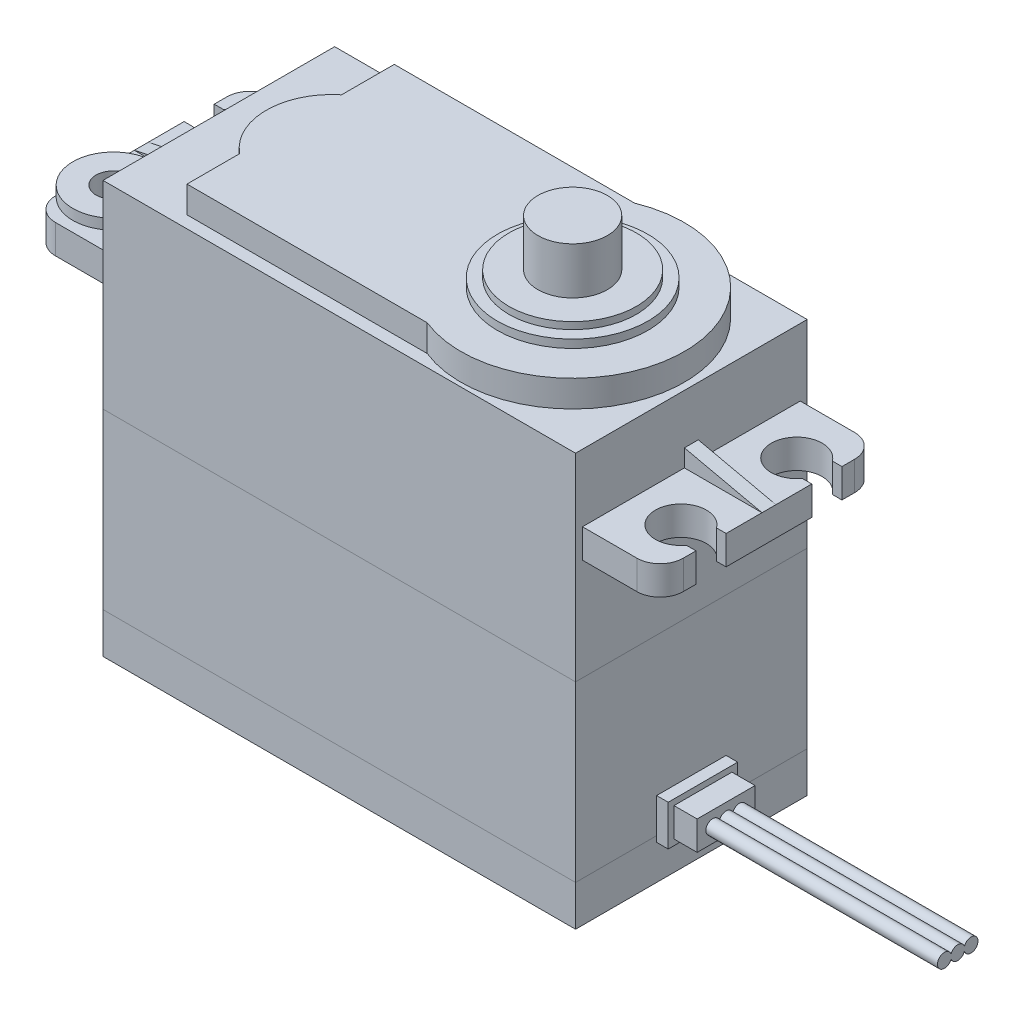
from build123d import *

# Parameters (mm, degrees)
ESQUISSE1_W                              = 40.8
ESQUISSE1_H                              = 20
BOSS_EXTRU_1_DEPTH                       = 35.6
BOSS_EXTRU_2_DEPTH                       = 2.5
BOSS_EXTRU_3_DEPTH                       = 0.6
CONG_1_R                                 = 2
BOSS_EXTRU_4_DEPTH                       = 2.3
ESQUISSE5_R                              = 6.5
BOSS_EXTRU_5_DEPTH                       = 0.7
ESQUISSE6_R                              = 5.5
BOSS_EXTRU_6_DEPTH                       = 0.6
ESQUISSE7_R                              = 3
BOSS_EXTRU_7_DEPTH                       = 4.05
ESQUISSE10_W                             = 2.2
ESQUISSE10_H                             = 29.8
DIAM_TRE_DU_PER_AGE_4_4_4_4_1_AT_2_COUNT = 2
DIAM_TRE_DU_PER_AGE_4_4_4_4_1_AT_2_PITCH = 10
DIAM_TRE_DU_PER_AGE_4_4_4_4_1_AT_3_COUNT = 2
DIAM_TRE_DU_PER_AGE_4_4_4_4_1_AT_3_PITCH = 50.009999
DIAM_TRE_DU_PER_AGE_4_4_4_4_1_AT_4_COUNT = 2
DIAM_TRE_DU_PER_AGE_4_4_4_4_1_AT_4_PITCH = 49
ESQUISSE13_W                             = 6
ESQUISSE13_H                             = 3.5
BOSS_EXTRU_8_DEPTH                       = 1
ESQUISSE14_W                             = 5
ESQUISSE14_H                             = 2.5
BOSS_EXTRU_9_DEPTH                       = 2
BOSS_EXTRU_10_DEPTH                      = 20


with BuildPart() as part:
    # Esquisse1 → Boss.-Extru.1 (new body)
    with BuildSketch(Plane(origin=(0, 0, 0), x_dir=(1, 0, 0), z_dir=(0, 1, 0))):
        Rectangle(ESQUISSE1_W, ESQUISSE1_H)
    extrude(amount=BOSS_EXTRU_1_DEPTH)

    # Esquisse2 → Boss.-Extru.2 (add)
    with BuildSketch(Plane(origin=(0, 27.3, 0), x_dir=(-1, 0, 0), z_dir=(0, -1, 0))):
        with BuildLine():
            Line((-27.1, 9.4), (-20.4, 9.4))
            Line((-20.4, 9.4), (-20.4, -9.4))
            Line((-20.4, -9.4), (-27.1, -9.4))
            Line((-27.1, -9.4), (-27.1, -6.3))
            Line((-27.1, -6.3), (-26.212454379, -6.3))
            ThreePointArc((-26.212454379, -6.3), (-22.35, -5), (-26.212454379, -3.7))
            Line((-26.212454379, -3.7), (-27.1, -3.7))
            Line((-27.1, -3.7), (-27.1, 3.7))
            Line((-27.1, 3.7), (-26.212454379, 3.7))
            ThreePointArc((-26.212454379, 3.7), (-22.35, 5), (-26.212454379, 6.3))
            Line((-26.212454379, 6.3), (-27.1, 6.3))
            Line((-27.1, 6.3), (-27.1, 9.4))
        make_face()
        with BuildLine():
            Line((27.1, 9.4), (20.4, 9.4))
            Line((20.4, 9.4), (20.4, -9.4))
            Line((20.4, -9.4), (27.1, -9.4))
            Line((27.1, -9.4), (27.1, -6.3))
            Line((27.1, -6.3), (26.212454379, -6.3))
            ThreePointArc((26.212454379, -6.3), (22.35, -5), (26.212454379, -3.7))
            Line((26.212454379, -3.7), (27.1, -3.7))
            Line((27.1, -3.7), (27.1, 3.7))
            Line((27.1, 3.7), (26.212454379, 3.7))
            ThreePointArc((26.212454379, 3.7), (22.35, 5), (26.212454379, 6.3))
            Line((26.212454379, 6.3), (27.1, 6.3))
            Line((27.1, 6.3), (27.1, 9.4))
        make_face()
    extrude(amount=-BOSS_EXTRU_2_DEPTH)

    # Esquisse3 → Boss.-Extru.3 (add, symmetric)
    with BuildSketch(Plane.XY):
        Polygon((-27.1, 29.8), (-20.4, 29.8), (-20.4, 31.3), align=None)
        Polygon((27.1, 29.8), (20.4, 29.8), (20.4, 31.3), align=None)
    extrude(amount=BOSS_EXTRU_3_DEPTH, both=True)

    # Cong_1
    cong_1_edges = [part.edges().sort_by_distance(p)[0] for p in [
        (27.1, 28.55, -9.4),
        (27.1, 28.55, 9.4),
        (-27.1, 28.55, -9.4),
        (-27.1, 28.55, 9.4),
    ]]
    fillet(cong_1_edges, radius=CONG_1_R)

    # Esquisse4 → Boss.-Extru.4 (add)
    with BuildSketch(Plane(origin=(0, 35.6, 0), x_dir=(1, 0, 0), z_dir=(0, 1, 0))):
        with BuildLine():
            Line((-14.2, 8.95), (6.541676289, 8.95))
            ThreePointArc((6.541676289, 8.95), (19.8, 0), (6.541676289, -8.95))
            Line((6.541676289, -8.95), (-14.2, -8.95))
            Line((-14.2, -8.95), (-14.2, -4.4))
            ThreePointArc((-14.2, -4.4), (-16.3, 0), (-14.2, 4.4))
            Line((-14.2, 4.4), (-14.2, 8.95))
        make_face()
    extrude(amount=BOSS_EXTRU_4_DEPTH)

    # Esquisse5 → Boss.-Extru.5 (add)
    with BuildSketch(Plane(origin=(0, 37.9, 0), x_dir=(1, 0, 0), z_dir=(0, 1, 0))):
        with Locations(Location((10.15, 0, 0), (0, 0, 270))):
            Circle(ESQUISSE5_R)
    extrude(amount=BOSS_EXTRU_5_DEPTH)

    # Esquisse6 → Boss.-Extru.6 (add)
    with BuildSketch(Plane(origin=(0, 38.6, 0), x_dir=(1, 0, 0), z_dir=(0, 1, 0))):
        with Locations(Location((10.15, 0, 0), (0, 0, 270))):
            Circle(ESQUISSE6_R)
    extrude(amount=BOSS_EXTRU_6_DEPTH)

    # Esquisse10 → Diam_tre du per_age _4.4 _4.4_1 (revolve, cut)
    with BuildSketch(Plane(origin=(-24.5, 29.8, -5), x_dir=(0, 0, 1), z_dir=(1, 0, 0))):
        with Locations((1.1, 14.9)):
            Rectangle(ESQUISSE10_W, ESQUISSE10_H)
    diam_tre_du_per_age_4_4_4_4_1 = revolve(axis=Axis((-24.5, 36.15, -5), (0, -1, 0)), mode=Mode.SUBTRACT)

    # Diam_tre du per_age _4.4 _4.4_1 at 2: Diam_tre du per_age _4.4 _4.4_1 ×2
    with Locations(*[(0, 0, i * DIAM_TRE_DU_PER_AGE_4_4_4_4_1_AT_2_PITCH) for i in range(1, DIAM_TRE_DU_PER_AGE_4_4_4_4_1_AT_2_COUNT)]):
        add(diam_tre_du_per_age_4_4_4_4_1, mode=Mode.SUBTRACT)

    # Diam_tre du per_age _4.4 _4.4_1 at 3: Diam_tre du per_age _4.4 _4.4_1 ×2
    with Locations(*[Vector(0.9798040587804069, 0, 0.1999600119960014) * (i * DIAM_TRE_DU_PER_AGE_4_4_4_4_1_AT_3_PITCH) for i in range(1, DIAM_TRE_DU_PER_AGE_4_4_4_4_1_AT_3_COUNT)]):
        add(diam_tre_du_per_age_4_4_4_4_1, mode=Mode.SUBTRACT)

    # Diam_tre du per_age _4.4 _4.4_1 at 4: Diam_tre du per_age _4.4 _4.4_1 ×2
    with Locations(*[(i * DIAM_TRE_DU_PER_AGE_4_4_4_4_1_AT_4_PITCH, 0, 0) for i in range(1, DIAM_TRE_DU_PER_AGE_4_4_4_4_1_AT_4_COUNT)]):
        add(diam_tre_du_per_age_4_4_4_4_1, mode=Mode.SUBTRACT)

    # Esquisse12 → R_volution1 (revolve)
    with BuildSketch(Plane(origin=(-24.5, 0, 0), x_dir=(0, 0, -1), z_dir=(1, 0, 0)), mode=Mode.PRIVATE) as r_volution1_sk:
        Polygon((-8.5, 29.8), (-8.5, 30.7), (-6.5, 30.7), (-6.5, 26.4), (-8.5, 26.4), (-8.5, 27.3), (-7.2, 27.3), (-7.2, 29.8), align=None)
    revolve(r_volution1_sk.sketch.rotate(Axis((-24.5, 27.3, 5), (0, 1, 0)), 180), axis=Axis((-24.5, 27.3, 5), (0, 1, 0)))



with BuildPart() as body_2:
    # Esquisse7 → Boss.-Extru.7 (new body)
    with BuildSketch(Plane(origin=(0, 39.2, 0), x_dir=(1, 0, 0), z_dir=(0, 1, 0))):
        with Locations(Location((10.15, 0, 0), (0, 0, 270))):
            Circle(ESQUISSE7_R)
    extrude(amount=BOSS_EXTRU_7_DEPTH)


with BuildPart() as body_3:
    # Esquisse13 → Boss.-Extru.8 (new body)
    with BuildSketch(Plane(origin=(20.4, 0, 0), x_dir=(0, 0, -1), z_dir=(1, 0, 0))):
        with Locations((0, 4.75)):
            Rectangle(ESQUISSE13_W, ESQUISSE13_H)
    extrude(amount=BOSS_EXTRU_8_DEPTH)


with BuildPart() as part_1:
    add(part.part)

    add(body_3.part)  # Boss.-Extru.9 merges body 3
    # Esquisse14 → Boss.-Extru.9 (add)
    with BuildSketch(Plane(origin=(21.4, 0, 0), x_dir=(0, 0, -1), z_dir=(1, 0, 0))):
        with Locations((0, 4.75)):
            Rectangle(ESQUISSE14_W, ESQUISSE14_H)
    extrude(amount=BOSS_EXTRU_9_DEPTH)


with BuildPart() as body_3_2:
    # Esquisse15 → Boss.-Extru.10 (new body)
    with BuildSketch(Plane(origin=(23.4, 0, 0), x_dir=(0, 0, -1), z_dir=(1, 0, 0))):
        with BuildLine():
            ThreePointArc((0.575, 4.921391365), (0, 5.35), (-0.575, 4.921391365))
            ThreePointArc((-0.575, 4.921391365), (-1.75, 4.75), (-0.575, 4.578608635))
            ThreePointArc((-0.575, 4.578608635), (0, 4.15), (0.575, 4.578608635))
            ThreePointArc((0.575, 4.578608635), (1.75, 4.75), (0.575, 4.921391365))
        make_face()
    extrude(amount=BOSS_EXTRU_10_DEPTH)


solid = Compound([body_2.part, part_1.part, body_3_2.part])
